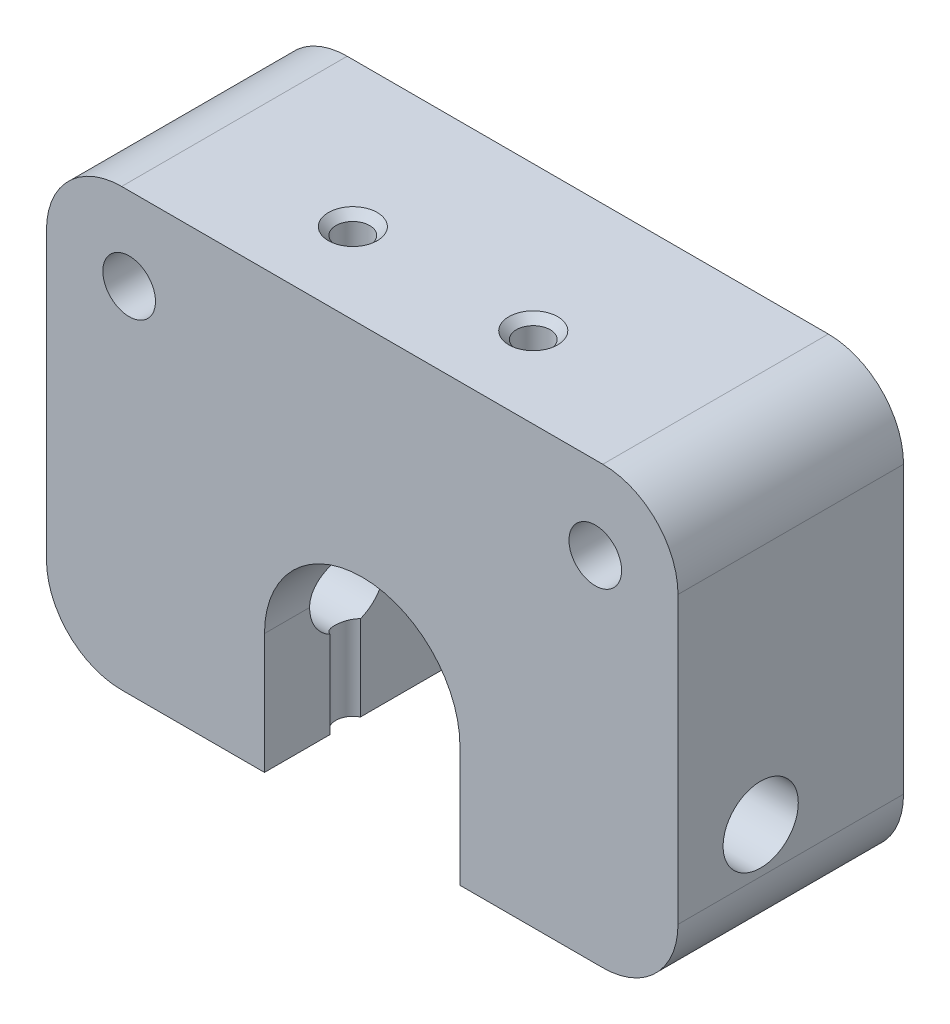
from build123d import *

# Parameters (mm, degrees)
SKETCH1_W           = 42
SKETCH1_H           = 29
BOSS_EXTRUDE1_DEPTH = 15
FILLET2_R           = 5
SKETCH2_R           = 1.75
CUT_EXTRUDE1_DEPTH  = 30.601520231
CUT_EXTRUDE2_DEPTH  = 30.601520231
SKETCH4_R           = 1.125
CUT_EXTRUDE3_DEPTH  = 39.820097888
CHAMFER1_SIZE       = 0.5
CHAMFER2_SIZE       = 0.5
SKETCH5_R           = 2.5
CUT_EXTRUDE4_DEPTH  = 47.896161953
CUT_EXTRUDE5_DEPTH  = 3


with BuildPart() as part:
    # Sketch1 → Boss-Extrude1 (new body)
    with BuildSketch(Plane.XY):
        Rectangle(SKETCH1_W, SKETCH1_H)
    extrude(amount=BOSS_EXTRUDE1_DEPTH)

    # Fillet2
    fillet2_edges = [part.edges().sort_by_distance(p)[0] for p in [
        (-21, 14.5, 7.5),
        (21, 14.5, 7.5),
        (21, -14.5, 7.5),
        (-21, -14.5, 7.5),
    ]]
    fillet(fillet2_edges, radius=FILLET2_R)

    # Sketch2 → Cut-Extrude1 (cut, through all)
    with BuildSketch(Plane.XY.offset(15)):
        with Locations((-15.5, 9)):
            Circle(SKETCH2_R)
        with Locations((15.5, 9)):
            Circle(SKETCH2_R)
    extrude(amount=-CUT_EXTRUDE1_DEPTH, mode=Mode.SUBTRACT)

    # Sketch3 → Cut-Extrude2 (cut, through all)
    with BuildSketch(Plane.XY.offset(15)):
        with BuildLine():
            Line((-6.5, -6.5), (-6.5, -14.5))
            Line((-6.5, -14.5), (6.5, -14.5))
            Line((6.5, -14.5), (6.5, -6.5))
            ThreePointArc((6.5, -6.5), (0, 0), (-6.5, -6.5))
        make_face()
    extrude(amount=-CUT_EXTRUDE2_DEPTH, mode=Mode.SUBTRACT)

    # Sketch4 → Cut-Extrude3 (cut, through all)
    with BuildSketch(Plane(origin=(0, 14.5, 0), x_dir=(-1, 0, 0), z_dir=(0, 1, 0))):
        with Locations(Location((6, 9.625, 0), (0, 0, 90))):
            Circle(SKETCH4_R)
        with Locations(Location((-6, 9.625, 0), (0, 0, 90))):
            Circle(SKETCH4_R)
    extrude(amount=-CUT_EXTRUDE3_DEPTH, mode=Mode.SUBTRACT)

    # Chamfer1
    chamfer1_edges = [part.edges().sort_by_distance(p)[0] for p in [
        (-6, 14.5, 8.5),
    ]]
    chamfer(chamfer1_edges, length=CHAMFER1_SIZE)

    # Chamfer2
    chamfer2_edges = [part.edges().sort_by_distance(p)[0] for p in [
        (6, 14.5, 8.5),
    ]]
    chamfer(chamfer2_edges, length=CHAMFER2_SIZE)

    # Sketch5 → Cut-Extrude4 (cut, through all)
    with BuildSketch(Plane(origin=(21, 0, 0), x_dir=(0, 0, -1), z_dir=(1, 0, 0))):
        with Locations((-9.5, -6.5)):
            Circle(SKETCH5_R)
    extrude(amount=-CUT_EXTRUDE4_DEPTH, mode=Mode.SUBTRACT)

    # Sketch6 → Cut-Extrude5 (cut)
    with BuildSketch(Plane(origin=(0, 0, 0), x_dir=(1, 0, 0), z_dir=(0, 0, -1))):
        with BuildLine():
            Line((-13.75, 6.5), (-13.75, 14.5))
            Line((-13.75, 14.5), (13.75, 14.5))
            Line((13.75, 14.5), (13.75, 6.5))
            ThreePointArc((13.75, 6.5), (0, -7.25), (-13.75, 6.5))
        make_face()
    extrude(amount=-CUT_EXTRUDE5_DEPTH, mode=Mode.SUBTRACT)


solid = part.part
